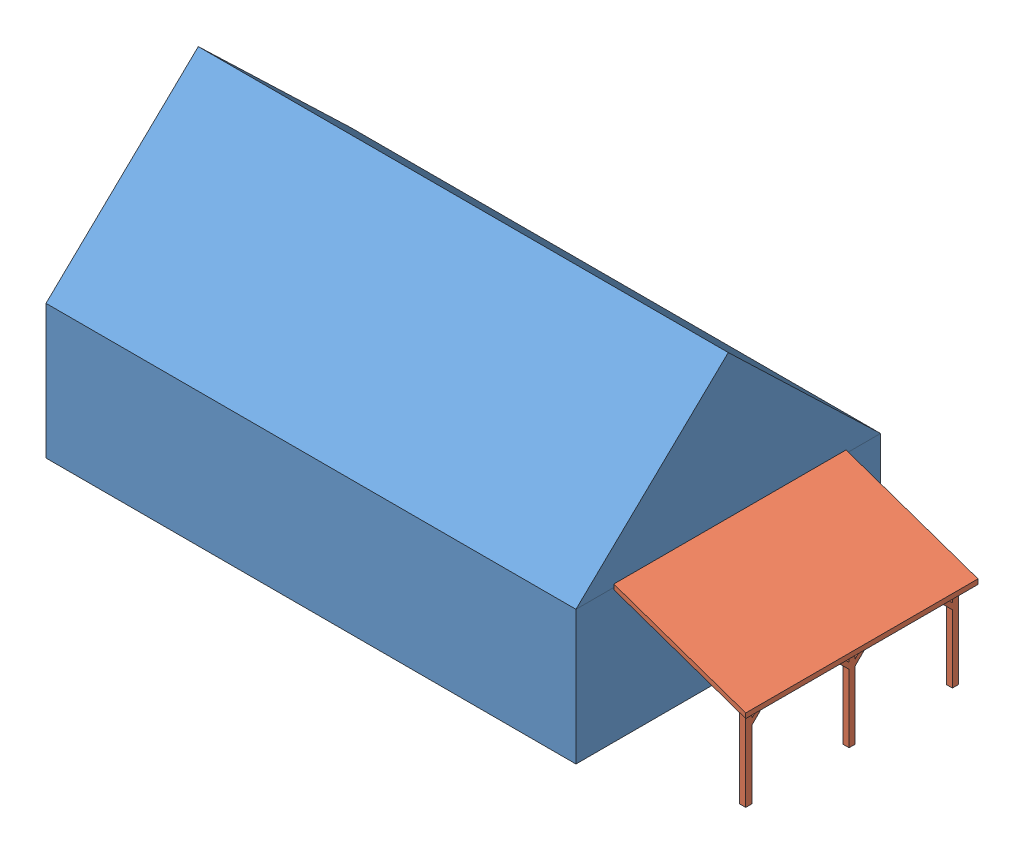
SolidWorks assembly Assemblage2.sldasm, configuration Défaut (file format 3400). Lengths in mm.
Overall size (108.66 46.04 50).
2 component instances, 2 part files, 1 mates.
Components (placement in the parent):
- maison2-1: maison2.SLDPRT [Défaut] at (2.074 -4.6495 -43.5) size (87 46 50)
- abri-1: abri.SLDPRT [Défaut] at (45.5582 -17.6473 -19.3386) size (21.66 22.53 38.13)
Mates (geometry in assembly coordinates):
- Coïncidente1: coincident anti-aligned: plane of maison2-1 through (45.5582 28.394 0) normal (1 0 0); plane of abri-1 through (45.5582 -17.6473 18.7914) normal (-1 0 0)
